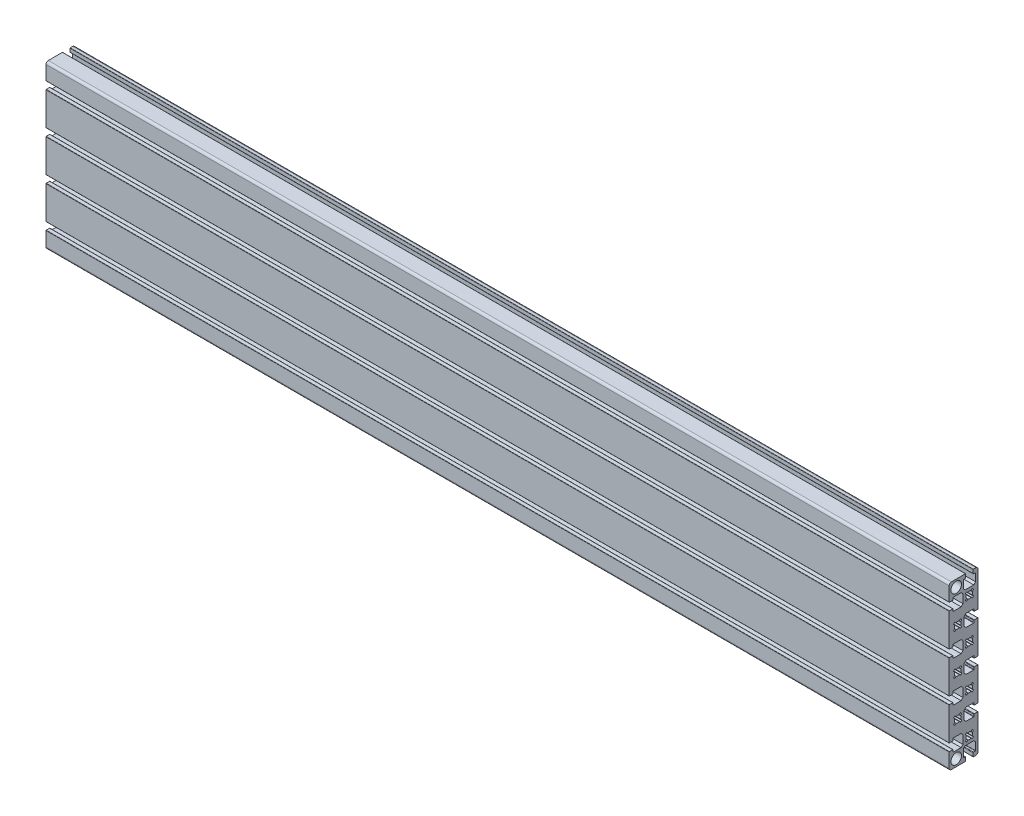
from build123d import *

# Parameters (mm, degrees)
MODEL11_R                        = 5.850000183
F_45_SARJA_1_0051_32X180_1_DEPTH = 1000


with BuildPart() as part:
    # Model11 → 45-sarja 1.0051 32X180_1 (new body)
    with BuildSketch(Plane(origin=(0, 0, 0), x_dir=(0, 0, -1), z_dir=(1, 0, 0))):
        with BuildLine():
            Line((15.606146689, 49.884395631), (15.606146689, 87.984396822))
            ThreePointArc((15.606146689, 87.984396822), (14.873908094, 89.752153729), (13.10614661, 90.484381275))
            Line((13.10614661, 90.484381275), (10.506146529, 90.484381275))
            ThreePointArc((10.506146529, 90.484381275), (10.294014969, 90.396513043), (10.206147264, 90.184381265))
            Line((10.206147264, 90.184381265), (10.206147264, 86.48438115))
            ThreePointArc((10.206147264, 86.48438115), (10.352593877, 86.130827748), (10.706147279, 85.984381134))
            Line((10.706147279, 85.984381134), (12.606147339, 85.984381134))
            ThreePointArc((12.606147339, 85.984381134), (12.818279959, 85.896511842), (12.906146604, 85.684378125))
            Line((12.906146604, 85.684378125), (12.906146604, 77.184374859))
            Line((12.906146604, 77.184374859), (10.906146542, 75.184374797))
            Line((10.906146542, 75.184374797), (1.306146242, 75.184374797))
            Line((1.306146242, 75.184374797), (-0.693852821, 77.184374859))
            Line((-0.693852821, 77.184374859), (-0.693852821, 85.684375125))
            ThreePointArc((-0.693852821, 85.684375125), (-0.605985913, 85.896509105), (-0.393852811, 85.984378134))
            Line((-0.393852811, 85.984378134), (1.506147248, 85.984378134))
            ThreePointArc((1.506147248, 85.984378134), (1.85970065, 86.130824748), (2.006147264, 86.48437815))
            Line((2.006147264, 86.48437815), (2.006147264, 90.184375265))
            ThreePointArc((2.006147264, 90.184375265), (1.918281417, 90.396511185), (1.706147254, 90.484381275))
            Line((1.706147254, 90.484381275), (-13.893853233, 90.484381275))
            ThreePointArc((-13.893853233, 90.484381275), (-15.661613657, 89.75215479), (-16.393853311, 87.984399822))
            Line((-16.393853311, 87.984399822), (-16.393853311, 72.384393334))
            ThreePointArc((-16.393853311, 72.384393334), (-16.305983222, 72.172265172), (-16.093853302, 72.084399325))
            Line((-16.093853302, 72.084399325), (-12.393853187, 72.084399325))
            ThreePointArc((-12.393853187, 72.084399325), (-12.040299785, 72.230845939), (-11.893853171, 72.58439934))
            Line((-11.893853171, 72.58439934), (-11.893853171, 74.4843994))
            ThreePointArc((-11.893853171, 74.4843994), (-11.805985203, 74.696531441), (-11.593853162, 74.784399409))
            Line((-11.593853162, 74.784399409), (-3.093853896, 74.784399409))
            Line((-3.093853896, 74.784399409), (-1.093853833, 72.784399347))
            Line((-1.093853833, 72.784399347), (-1.093853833, 63.184393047))
            Line((-1.093853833, 63.184393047), (-3.093853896, 61.184392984))
            Line((-3.093853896, 61.184392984), (-11.593854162, 61.184392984))
            ThreePointArc((-11.593854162, 61.184392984), (-11.805985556, 61.272261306), (-11.893853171, 61.484392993))
            Line((-11.893853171, 61.484392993), (-11.893853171, 63.384387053))
            ThreePointArc((-11.893853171, 63.384387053), (-12.040297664, 63.737944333), (-12.393853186, 63.884393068))
            Line((-12.393853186, 63.884393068), (-16.093854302, 63.884393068))
            ThreePointArc((-16.093854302, 63.884393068), (-16.305985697, 63.796524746), (-16.393853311, 63.584393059))
            Line((-16.393853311, 63.584393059), (-16.393853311, 27.384393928))
            ThreePointArc((-16.393853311, 27.384393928), (-16.305988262, 27.17225655), (-16.093853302, 27.084385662))
            Line((-16.093853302, 27.084385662), (-12.393853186, 27.084385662))
            ThreePointArc((-12.393853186, 27.084385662), (-12.040299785, 27.230832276), (-11.893853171, 27.584385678))
            Line((-11.893853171, 27.584385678), (-11.893853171, 29.484385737))
            ThreePointArc((-11.893853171, 29.484385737), (-11.805987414, 29.696521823), (-11.593853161, 29.784392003))
            Line((-11.593853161, 29.784392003), (-3.093853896, 29.784392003))
            Line((-3.093853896, 29.784392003), (-1.093853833, 27.78439194))
            Line((-1.093853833, 27.78439194), (-1.093853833, 18.18438564))
            Line((-1.093853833, 18.18438564), (-3.093853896, 16.184385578))
            Line((-3.093853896, 16.184385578), (-11.593854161, 16.184385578))
            ThreePointArc((-11.593854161, 16.184385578), (-11.805985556, 16.2722539), (-11.893853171, 16.484385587))
            Line((-11.893853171, 16.484385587), (-11.893853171, 18.384387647))
            ThreePointArc((-11.893853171, 18.384387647), (-12.040300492, 18.737939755), (-12.393853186, 18.884385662))
            Line((-12.393853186, 18.884385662), (-16.093854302, 18.884385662))
            ThreePointArc((-16.093854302, 18.884385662), (-16.305985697, 18.79651734), (-16.393853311, 18.584385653))
            Line((-16.393853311, 18.584385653), (-16.393853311, -17.615615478))
            ThreePointArc((-16.393853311, -17.615615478), (-16.305986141, -17.827748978), (-16.093853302, -17.915617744))
            Line((-16.093853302, -17.915617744), (-12.393853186, -17.915617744))
            ThreePointArc((-12.393853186, -17.915617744), (-12.040299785, -17.76917113), (-11.893853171, -17.415617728))
            Line((-11.893853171, -17.415617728), (-11.893853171, -15.515617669))
            ThreePointArc((-11.893853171, -15.515617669), (-11.805986, -15.30348417), (-11.593853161, -15.215615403))
            Line((-11.593853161, -15.215615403), (-3.093853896, -15.215615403))
            Line((-3.093853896, -15.215615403), (-1.093853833, -17.215615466))
            Line((-1.093853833, -17.215615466), (-1.093853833, -26.815617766))
            Line((-1.093853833, -26.815617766), (-3.093853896, -28.815617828))
            Line((-3.093853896, -28.815617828), (-11.593854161, -28.815617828))
            ThreePointArc((-11.593854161, -28.815617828), (-11.805985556, -28.727749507), (-11.893853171, -28.515617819))
            Line((-11.893853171, -28.515617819), (-11.893853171, -26.61561576))
            ThreePointArc((-11.893853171, -26.61561576), (-12.040300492, -26.262063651), (-12.393853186, -26.115617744))
            Line((-12.393853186, -26.115617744), (-16.093854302, -26.115617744))
            ThreePointArc((-16.093854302, -26.115617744), (-16.305985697, -26.203486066), (-16.393853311, -26.415617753))
            Line((-16.393853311, -26.415617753), (-16.393853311, -62.615618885))
            ThreePointArc((-16.393853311, -62.615618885), (-16.30598508, -62.827750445), (-16.093853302, -62.91561815))
            Line((-16.093853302, -62.91561815), (-12.393853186, -62.91561815))
            ThreePointArc((-12.393853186, -62.91561815), (-12.040299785, -62.769171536), (-11.893853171, -62.415618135))
            Line((-11.893853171, -62.415618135), (-11.893853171, -60.515618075))
            ThreePointArc((-11.893853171, -60.515618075), (-11.80598494, -60.303486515), (-11.593853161, -60.21561881))
            Line((-11.593853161, -60.21561881), (-3.093853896, -60.21561881))
            Line((-3.093853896, -60.21561881), (-1.093853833, -62.215618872))
            Line((-1.093853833, -62.215618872), (-1.093853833, -71.815617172))
            Line((-1.093853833, -71.815617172), (-3.093853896, -73.815618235))
            Line((-3.093853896, -73.815618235), (-11.593854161, -73.815618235))
            ThreePointArc((-11.593854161, -73.815618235), (-11.805985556, -73.727749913), (-11.893853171, -73.515618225))
            Line((-11.893853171, -73.515618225), (-11.893853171, -71.615618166))
            ThreePointArc((-11.893853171, -71.615618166), (-12.040299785, -71.262064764), (-12.393853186, -71.11561815))
            Line((-12.393853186, -71.11561815), (-16.093854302, -71.11561815))
            ThreePointArc((-16.093854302, -71.11561815), (-16.305985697, -71.203486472), (-16.393853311, -71.41561816))
            Line((-16.393853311, -71.41561816), (-16.393853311, -87.015618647))
            ThreePointArc((-16.393853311, -87.015618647), (-15.661620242, -88.783385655), (-13.893853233, -89.515618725))
            Line((-13.893853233, -89.515618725), (1.706147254, -89.515618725))
            ThreePointArc((1.706147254, -89.515618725), (1.918279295, -89.427750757), (2.006147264, -89.215618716))
            Line((2.006147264, -89.215618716), (2.006147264, -85.5156186))
            ThreePointArc((2.006147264, -85.5156186), (1.85970065, -85.162065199), (1.506147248, -85.015618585))
            Line((1.506147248, -85.015618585), (-0.393852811, -85.015618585))
            ThreePointArc((-0.393852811, -85.015618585), (-0.605984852, -84.927750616), (-0.693852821, -84.715618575))
            Line((-0.693852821, -84.715618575), (-0.693852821, -76.21561831))
            Line((-0.693852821, -76.21561831), (1.306146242, -74.215618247))
            Line((1.306146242, -74.215618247), (10.906146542, -74.215618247))
            Line((10.906146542, -74.215618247), (12.906146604, -76.21561831))
            Line((12.906146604, -76.21561831), (12.906146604, -84.715618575))
            ThreePointArc((12.906146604, -84.715618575), (12.818278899, -84.927750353), (12.606147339, -85.015618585))
            Line((12.606147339, -85.015618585), (10.706147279, -85.015618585))
            ThreePointArc((10.706147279, -85.015618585), (10.352593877, -85.162065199), (10.206147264, -85.5156186))
            Line((10.206147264, -85.5156186), (10.206147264, -89.215618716))
            ThreePointArc((10.206147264, -89.215618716), (10.294014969, -89.427750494), (10.506146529, -89.515618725))
            Line((10.506146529, -89.515618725), (13.10614661, -89.515618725))
            ThreePointArc((13.10614661, -89.515618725), (14.873913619, -88.783385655), (15.606146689, -87.015618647))
            Line((15.606146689, -87.015618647), (15.606146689, -48.915619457))
            ThreePointArc((15.606146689, -48.915619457), (15.518279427, -48.703486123), (15.306146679, -48.615617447))
            Line((15.306146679, -48.615617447), (11.606146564, -48.615617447))
            ThreePointArc((11.606146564, -48.615617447), (11.252593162, -48.762064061), (11.106146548, -49.115617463))
            Line((11.106146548, -49.115617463), (11.106146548, -51.015617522))
            ThreePointArc((11.106146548, -51.015617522), (11.01827858, -51.227749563), (10.806146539, -51.315617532))
            Line((10.806146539, -51.315617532), (2.306146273, -51.315617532))
            Line((2.306146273, -51.315617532), (0.30614621, -49.315617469))
            Line((0.30614621, -49.315617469), (0.30614621, -39.715619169))
            Line((0.30614621, -39.715619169), (2.306146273, -37.715619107))
            Line((2.306146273, -37.715619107), (10.806146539, -37.715619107))
            ThreePointArc((10.806146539, -37.715619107), (11.01827858, -37.803487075), (11.106146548, -38.015619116))
            Line((11.106146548, -38.015619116), (11.106146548, -39.915621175))
            ThreePointArc((11.106146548, -39.915621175), (11.252594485, -40.269172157), (11.606146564, -40.415617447))
            Line((11.606146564, -40.415617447), (15.306146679, -40.415617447))
            ThreePointArc((15.306146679, -40.415617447), (15.518278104, -40.327750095), (15.606146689, -40.115619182))
            Line((15.606146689, -40.115619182), (15.606146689, -3.91562005))
            ThreePointArc((15.606146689, -3.91562005), (15.518279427, -3.703486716), (15.306146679, -3.615618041))
            Line((15.306146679, -3.615618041), (11.606146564, -3.615618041))
            ThreePointArc((11.606146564, -3.615618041), (11.252593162, -3.762064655), (11.106146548, -4.115618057))
            Line((11.106146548, -4.115618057), (11.106146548, -6.015618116))
            ThreePointArc((11.106146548, -6.015618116), (11.01827858, -6.227750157), (10.806146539, -6.315618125))
            Line((10.806146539, -6.315618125), (2.306146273, -6.315618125))
            Line((2.306146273, -6.315618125), (0.30614621, -4.315618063))
            Line((0.30614621, -4.315618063), (0.30614621, 5.284388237))
            Line((0.30614621, 5.284388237), (2.306146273, 7.2843883))
            Line((2.306146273, 7.2843883), (10.806146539, 7.2843883))
            ThreePointArc((10.806146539, 7.2843883), (11.01827858, 7.196520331), (11.106146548, 6.98438829))
            Line((11.106146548, 6.98438829), (11.106146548, 5.084386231))
            ThreePointArc((11.106146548, 5.084386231), (11.252591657, 4.730830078), (11.606146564, 4.584381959))
            Line((11.606146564, 4.584381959), (15.306146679, 4.584381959))
            ThreePointArc((15.306146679, 4.584381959), (15.518281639, 4.672252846), (15.606146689, 4.884390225))
            Line((15.606146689, 4.884390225), (15.606146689, 41.084395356))
            ThreePointArc((15.606146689, 41.084395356), (15.518276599, 41.296523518), (15.306146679, 41.384389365))
            Line((15.306146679, 41.384389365), (11.606146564, 41.384389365))
            ThreePointArc((11.606146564, 41.384389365), (11.252593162, 41.237942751), (11.106146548, 40.88438935))
            Line((11.106146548, 40.88438935), (11.106146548, 38.98438929))
            ThreePointArc((11.106146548, 38.98438929), (11.01827858, 38.772257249), (10.806146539, 38.684389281))
            Line((10.806146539, 38.684389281), (2.306146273, 38.684389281))
            Line((2.306146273, 38.684389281), (0.30614621, 40.684389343))
            Line((0.30614621, 40.684389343), (0.30614621, 50.284395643))
            Line((0.30614621, 50.284395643), (2.306146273, 52.284395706))
            Line((2.306146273, 52.284395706), (10.806146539, 52.284395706))
            ThreePointArc((10.806146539, 52.284395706), (11.01827858, 52.196527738), (11.106146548, 51.984395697))
            Line((11.106146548, 51.984395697), (11.106146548, 50.084401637))
            ThreePointArc((11.106146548, 50.084401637), (11.252588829, 49.730840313), (11.606146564, 49.584389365))
            Line((11.606146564, 49.584389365), (15.306146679, 49.584389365))
            ThreePointArc((15.306146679, 49.584389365), (15.518280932, 49.672259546), (15.606146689, 49.884395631))
        make_face()
        with Locations((-8.543853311, 82.634381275)):
            Circle(MODEL11_R, mode=Mode.SUBTRACT)
        with Locations((-8.543853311, -81.665618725)):
            Circle(MODEL11_R, mode=Mode.SUBTRACT)
        with BuildLine():
            Line((10.490204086, 71.378498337), (9.500254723, 72.3684487))
            ThreePointArc((9.500254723, 72.3684487), (9.288122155, 72.456316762), (9.075989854, 72.368448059))
            Line((9.075989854, 72.368448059), (8.055218, 71.347677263))
            ThreePointArc((8.055218, 71.347677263), (7.892831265, 71.263962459), (7.711995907, 71.289966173))
            ThreePointArc((7.711995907, 71.289966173), (6.106141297, 71.659386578), (4.500286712, 71.289966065))
            ThreePointArc((4.500286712, 71.289966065), (4.319451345, 71.26396234), (4.157064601, 71.347677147))
            Line((4.157064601, 71.347677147), (3.136293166, 72.368447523))
            ThreePointArc((3.136293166, 72.368447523), (2.924161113, 72.456315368), (2.712029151, 72.368447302))
            Line((2.712029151, 72.368447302), (1.722080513, 71.378497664))
            ThreePointArc((1.722080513, 71.378497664), (1.634212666, 71.166365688), (1.72208062, 70.954233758))
            Line((1.72208062, 70.954233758), (2.742850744, 69.933463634))
            ThreePointArc((2.742850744, 69.933463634), (2.826565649, 69.771076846), (2.800561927, 69.590241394))
            ThreePointArc((2.800561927, 69.590241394), (2.431141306, 67.984386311), (2.800562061, 66.378531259))
            ThreePointArc((2.800562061, 66.378531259), (2.826565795, 66.197695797), (2.742850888, 66.035308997))
            Line((2.742850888, 66.035308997), (1.722080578, 65.014538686))
            ThreePointArc((1.722080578, 65.014538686), (1.634212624, 64.802407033), (1.722080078, 64.590275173))
            Line((1.722080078, 64.590275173), (2.712029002, 63.600325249))
            ThreePointArc((2.712029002, 63.600325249), (2.92416104, 63.512457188), (3.136293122, 63.600325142))
            Line((3.136293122, 63.600325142), (4.157064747, 64.621095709))
            ThreePointArc((4.157064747, 64.621095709), (4.319451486, 64.704810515), (4.500286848, 64.678806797))
            ThreePointArc((4.500286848, 64.678806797), (6.106141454, 64.309386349), (7.711996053, 64.678806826))
            ThreePointArc((7.711996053, 64.678806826), (7.892831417, 64.704810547), (8.055218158, 64.621095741))
            Line((8.055218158, 64.621095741), (9.075990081, 63.600324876))
            ThreePointArc((9.075990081, 63.600324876), (9.288122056, 63.512457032), (9.500253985, 63.600324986))
            Line((9.500253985, 63.600324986), (10.490203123, 64.590275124))
            ThreePointArc((10.490203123, 64.590275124), (10.57807097, 64.802406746), (10.490203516, 65.01453853))
            Line((10.490203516, 65.01453853), (9.469432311, 66.035309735))
            ThreePointArc((9.469432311, 66.035309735), (9.385717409, 66.197696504), (9.411721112, 66.378531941))
            ThreePointArc((9.411721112, 66.378531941), (9.781141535, 67.984386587), (9.411721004, 69.590241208))
            ThreePointArc((9.411721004, 69.590241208), (9.385717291, 69.771076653), (9.469432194, 69.933463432))
            Line((9.469432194, 69.933463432), (10.490203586, 70.954234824))
            ThreePointArc((10.490203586, 70.954234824), (10.57807154, 71.166366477), (10.490204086, 71.378498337))
        make_face(mode=Mode.SUBTRACT)
        with BuildLine():
            Line((10.490209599, -63.621506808), (9.500259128, -62.631556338))
            ThreePointArc((9.500259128, -62.631556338), (9.288126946, -62.543688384), (9.075994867, -62.631556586))
            Line((9.075994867, -62.631556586), (8.055223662, -63.652327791))
            ThreePointArc((8.055223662, -63.652327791), (7.892836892, -63.736042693), (7.712001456, -63.71003899))
            ThreePointArc((7.712001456, -63.71003899), (6.10614681, -63.340618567), (4.500292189, -63.710039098))
            ThreePointArc((4.500292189, -63.710039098), (4.319456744, -63.736042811), (4.157069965, -63.652327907))
            Line((4.157069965, -63.652327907), (3.136299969, -62.631557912))
            ThreePointArc((3.136299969, -62.631557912), (2.924167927, -62.543689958), (2.712035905, -62.631557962))
            Line((2.712035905, -62.631557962), (1.722086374, -63.621507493))
            ThreePointArc((1.722086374, -63.621507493), (1.63421842, -63.8336395), (1.722086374, -64.045771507))
            Line((1.722086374, -64.045771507), (2.742856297, -65.066541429))
            ThreePointArc((2.742856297, -65.066541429), (2.826571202, -65.22892822), (2.800567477, -65.409763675))
            ThreePointArc((2.800567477, -65.409763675), (2.431146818, -67.015618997), (2.800567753, -68.621474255))
            ThreePointArc((2.800567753, -68.621474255), (2.826571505, -68.802309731), (2.742856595, -68.964696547))
            Line((2.742856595, -68.964696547), (1.722086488, -69.985466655))
            ThreePointArc((1.722086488, -69.985466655), (1.634218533, -70.197598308), (1.722085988, -70.409730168))
            Line((1.722085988, -70.409730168), (2.712035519, -71.399679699))
            ThreePointArc((2.712035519, -71.399679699), (2.924167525, -71.487547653), (3.136299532, -71.399679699))
            Line((3.136299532, -71.399679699), (4.157069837, -70.378909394))
            ThreePointArc((4.157069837, -70.378909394), (4.319456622, -70.295194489), (4.500292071, -70.321198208))
            ThreePointArc((4.500292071, -70.321198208), (6.106147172, -70.690618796), (7.712002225, -70.321197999))
            ThreePointArc((7.712002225, -70.321197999), (7.892837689, -70.29519426), (8.055224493, -70.378909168))
            Line((8.055224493, -70.378909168), (9.075994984, -71.399679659))
            ThreePointArc((9.075994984, -71.399679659), (9.288126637, -71.487547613), (9.500258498, -71.399680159))
            Line((9.500258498, -71.399680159), (10.490208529, -70.409730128))
            ThreePointArc((10.490208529, -70.409730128), (10.578076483, -70.197598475), (10.490209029, -69.985466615))
            Line((10.490209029, -69.985466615), (9.469437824, -68.96469541))
            ThreePointArc((9.469437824, -68.96469541), (9.385722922, -68.802308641), (9.411726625, -68.621473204))
            ThreePointArc((9.411726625, -68.621473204), (9.781147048, -67.015618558), (9.411726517, -65.409763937))
            ThreePointArc((9.411726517, -65.409763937), (9.385722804, -65.228928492), (9.469437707, -65.066541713))
            Line((9.469437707, -65.066541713), (10.490209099, -64.045770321))
            ThreePointArc((10.490209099, -64.045770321), (10.578077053, -63.833638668), (10.490209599, -63.621506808))
        make_face(mode=Mode.SUBTRACT)
        with BuildLine():
            Line((-2.509793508, -41.121504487), (-3.499743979, -40.131554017))
            ThreePointArc((-3.499743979, -40.131554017), (-3.711876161, -40.043686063), (-3.92400824, -40.131554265))
            Line((-3.92400824, -40.131554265), (-4.944779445, -41.15232547))
            ThreePointArc((-4.944779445, -41.15232547), (-5.107166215, -41.236040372), (-5.288001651, -41.210036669))
            ThreePointArc((-5.288001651, -41.210036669), (-6.893856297, -40.840616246), (-8.499710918, -41.210036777))
            ThreePointArc((-8.499710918, -41.210036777), (-8.680546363, -41.23604049), (-8.842933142, -41.152325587))
            Line((-8.842933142, -41.152325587), (-9.863703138, -40.131555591))
            ThreePointArc((-9.863703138, -40.131555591), (-10.07583518, -40.043687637), (-10.287967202, -40.131555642))
            Line((-10.287967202, -40.131555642), (-11.277916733, -41.121505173))
            ThreePointArc((-11.277916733, -41.121505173), (-11.365784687, -41.333637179), (-11.277916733, -41.545769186))
            Line((-11.277916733, -41.545769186), (-10.25714681, -42.566539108))
            ThreePointArc((-10.25714681, -42.566539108), (-10.173431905, -42.7289259), (-10.19943563, -42.909761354))
            ThreePointArc((-10.19943563, -42.909761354), (-10.568856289, -44.515616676), (-10.199435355, -46.121471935))
            ThreePointArc((-10.199435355, -46.121471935), (-10.173431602, -46.30230741), (-10.257146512, -46.464694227))
            Line((-10.257146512, -46.464694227), (-11.277916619, -47.485464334))
            ThreePointArc((-11.277916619, -47.485464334), (-11.365784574, -47.697595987), (-11.277917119, -47.909727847))
            Line((-11.277917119, -47.909727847), (-10.287967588, -48.899677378))
            ThreePointArc((-10.287967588, -48.899677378), (-10.075835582, -48.987545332), (-9.863703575, -48.899677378))
            Line((-9.863703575, -48.899677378), (-8.84293327, -47.878907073))
            ThreePointArc((-8.84293327, -47.878907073), (-8.680546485, -47.795192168), (-8.499711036, -47.821195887))
            ThreePointArc((-8.499711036, -47.821195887), (-6.893855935, -48.190616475), (-5.288000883, -47.821195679))
            ThreePointArc((-5.288000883, -47.821195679), (-5.107165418, -47.79519194), (-4.944778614, -47.878906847))
            Line((-4.944778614, -47.878906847), (-3.924008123, -48.899677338))
            ThreePointArc((-3.924008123, -48.899677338), (-3.71187647, -48.987545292), (-3.499744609, -48.899677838))
            Line((-3.499744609, -48.899677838), (-2.509794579, -47.909727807))
            ThreePointArc((-2.509794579, -47.909727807), (-2.421926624, -47.697596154), (-2.509794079, -47.485464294))
            Line((-2.509794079, -47.485464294), (-3.530565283, -46.464693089))
            ThreePointArc((-3.530565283, -46.464693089), (-3.614280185, -46.30230632), (-3.588276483, -46.121470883))
            ThreePointArc((-3.588276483, -46.121470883), (-3.218856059, -44.515616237), (-3.58827659, -42.909761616))
            ThreePointArc((-3.58827659, -42.909761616), (-3.614280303, -42.728926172), (-3.5305654, -42.566539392))
            Line((-3.5305654, -42.566539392), (-2.509794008, -41.545768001))
            ThreePointArc((-2.509794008, -41.545768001), (-2.421926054, -41.333636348), (-2.509793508, -41.121504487))
        make_face(mode=Mode.SUBTRACT)
        with BuildLine():
            Line((10.490207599, -18.621505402), (9.500258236, -17.631555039))
            ThreePointArc((9.500258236, -17.631555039), (9.288125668, -17.543686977), (9.075993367, -17.63155568))
            Line((9.075993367, -17.63155568), (8.055221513, -18.652326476))
            ThreePointArc((8.055221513, -18.652326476), (7.892834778, -18.73604128), (7.71199942, -18.710037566))
            ThreePointArc((7.71199942, -18.710037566), (6.10614481, -18.34061716), (4.500290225, -18.710037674))
            ThreePointArc((4.500290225, -18.710037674), (4.319454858, -18.736041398), (4.157068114, -18.652326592))
            Line((4.157068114, -18.652326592), (3.136296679, -17.631556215))
            ThreePointArc((3.136296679, -17.631556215), (2.924164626, -17.543688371), (2.712032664, -17.631556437))
            Line((2.712032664, -17.631556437), (1.722084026, -18.621506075))
            ThreePointArc((1.722084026, -18.621506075), (1.634216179, -18.83363805), (1.722084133, -19.045769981))
            Line((1.722084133, -19.045769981), (2.742854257, -20.066540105))
            ThreePointArc((2.742854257, -20.066540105), (2.826569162, -20.228926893), (2.80056544, -20.409762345))
            ThreePointArc((2.80056544, -20.409762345), (2.431144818, -22.015617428), (2.800565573, -23.62147248))
            ThreePointArc((2.800565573, -23.62147248), (2.826569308, -23.802307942), (2.742854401, -23.964694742))
            Line((2.742854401, -23.964694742), (1.722084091, -24.985465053))
            ThreePointArc((1.722084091, -24.985465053), (1.634216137, -25.197596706), (1.722083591, -25.409728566))
            Line((1.722083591, -25.409728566), (2.712032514, -26.39967849))
            ThreePointArc((2.712032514, -26.39967849), (2.924164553, -26.487546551), (3.136296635, -26.399678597))
            Line((3.136296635, -26.399678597), (4.15706826, -25.37890803))
            ThreePointArc((4.15706826, -25.37890803), (4.319454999, -25.295193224), (4.500290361, -25.321196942))
            ThreePointArc((4.500290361, -25.321196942), (6.106144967, -25.69061739), (7.711999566, -25.321196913))
            ThreePointArc((7.711999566, -25.321196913), (7.89283493, -25.295193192), (8.055221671, -25.378907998))
            Line((8.055221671, -25.378907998), (9.075993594, -26.399678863))
            ThreePointArc((9.075993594, -26.399678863), (9.288125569, -26.487546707), (9.500257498, -26.399678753))
            Line((9.500257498, -26.399678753), (10.490206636, -25.409728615))
            ThreePointArc((10.490206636, -25.409728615), (10.578074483, -25.197596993), (10.490207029, -24.985465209))
            Line((10.490207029, -24.985465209), (9.469435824, -23.964694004))
            ThreePointArc((9.469435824, -23.964694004), (9.385720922, -23.802307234), (9.411724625, -23.621471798))
            ThreePointArc((9.411724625, -23.621471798), (9.781145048, -22.015617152), (9.411724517, -20.409762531))
            ThreePointArc((9.411724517, -20.409762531), (9.385720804, -20.228927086), (9.469435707, -20.066540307))
            Line((9.469435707, -20.066540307), (10.490207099, -19.045768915))
            ThreePointArc((10.490207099, -19.045768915), (10.578075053, -18.833637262), (10.490207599, -18.621505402))
        make_face(mode=Mode.SUBTRACT)
        with BuildLine():
            Line((-2.509791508, 3.878494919), (-3.499740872, 4.868445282))
            ThreePointArc((-3.499740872, 4.868445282), (-3.711873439, 4.956313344), (-3.92400574, 4.868444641))
            Line((-3.92400574, 4.868444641), (-4.944777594, 3.847673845))
            ThreePointArc((-4.944777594, 3.847673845), (-5.107164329, 3.763959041), (-5.287999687, 3.789962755))
            ThreePointArc((-5.287999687, 3.789962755), (-6.893854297, 4.15938316), (-8.499708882, 3.789962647))
            ThreePointArc((-8.499708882, 3.789962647), (-8.680544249, 3.763958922), (-8.842930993, 3.847673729))
            Line((-8.842930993, 3.847673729), (-9.863702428, 4.868444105))
            ThreePointArc((-9.863702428, 4.868444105), (-10.075834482, 4.95631195), (-10.287966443, 4.868443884))
            Line((-10.287966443, 4.868443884), (-11.277915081, 3.878494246))
            ThreePointArc((-11.277915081, 3.878494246), (-11.365782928, 3.66636227), (-11.277914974, 3.45423034))
            Line((-11.277914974, 3.45423034), (-10.25714485, 2.433460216))
            ThreePointArc((-10.25714485, 2.433460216), (-10.173429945, 2.271073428), (-10.199433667, 2.090237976))
            ThreePointArc((-10.199433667, 2.090237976), (-10.568854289, 0.484382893), (-10.199433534, -1.121472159))
            ThreePointArc((-10.199433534, -1.121472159), (-10.173429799, -1.302307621), (-10.257144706, -1.464694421))
            Line((-10.257144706, -1.464694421), (-11.277915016, -2.485464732))
            ThreePointArc((-11.277915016, -2.485464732), (-11.365782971, -2.697596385), (-11.277915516, -2.909728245))
            Line((-11.277915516, -2.909728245), (-10.287966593, -3.899678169))
            ThreePointArc((-10.287966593, -3.899678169), (-10.075834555, -3.98754623), (-9.863702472, -3.899678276))
            Line((-9.863702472, -3.899678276), (-8.842930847, -2.878907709))
            ThreePointArc((-8.842930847, -2.878907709), (-8.680544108, -2.795192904), (-8.499708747, -2.821196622))
            ThreePointArc((-8.499708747, -2.821196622), (-6.89385414, -3.190617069), (-5.287999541, -2.821196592))
            ThreePointArc((-5.287999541, -2.821196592), (-5.107164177, -2.795192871), (-4.944777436, -2.878907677))
            Line((-4.944777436, -2.878907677), (-3.924005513, -3.899678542))
            ThreePointArc((-3.924005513, -3.899678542), (-3.711873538, -3.987546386), (-3.499741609, -3.899678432))
            Line((-3.499741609, -3.899678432), (-2.509792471, -2.909728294))
            ThreePointArc((-2.509792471, -2.909728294), (-2.421924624, -2.697596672), (-2.509792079, -2.485464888))
            Line((-2.509792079, -2.485464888), (-3.530563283, -1.464693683))
            ThreePointArc((-3.530563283, -1.464693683), (-3.614278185, -1.302306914), (-3.588274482, -1.121471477))
            ThreePointArc((-3.588274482, -1.121471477), (-3.218854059, 0.484383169), (-3.58827459, 2.09023779))
            ThreePointArc((-3.58827459, 2.09023779), (-3.614278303, 2.271073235), (-3.5305634, 2.433460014))
            Line((-3.5305634, 2.433460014), (-2.509792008, 3.454231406))
            ThreePointArc((-2.509792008, 3.454231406), (-2.421924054, 3.666363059), (-2.509791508, 3.878494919))
        make_face(mode=Mode.SUBTRACT)
        with BuildLine():
            Line((10.490207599, 26.378496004), (9.500258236, 27.368446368))
            ThreePointArc((9.500258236, 27.368446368), (9.288125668, 27.456314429), (9.075993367, 27.368445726))
            Line((9.075993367, 27.368445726), (8.055221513, 26.347674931))
            ThreePointArc((8.055221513, 26.347674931), (7.892834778, 26.263960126), (7.71199942, 26.28996384))
            ThreePointArc((7.71199942, 26.28996384), (6.10614481, 26.659384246), (4.500290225, 26.289963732))
            ThreePointArc((4.500290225, 26.289963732), (4.319454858, 26.263960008), (4.157068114, 26.347674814))
            Line((4.157068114, 26.347674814), (3.136296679, 27.368445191))
            ThreePointArc((3.136296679, 27.368445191), (2.924164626, 27.456313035), (2.712032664, 27.368444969))
            Line((2.712032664, 27.368444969), (1.722084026, 26.378495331))
            ThreePointArc((1.722084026, 26.378495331), (1.634216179, 26.166363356), (1.722084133, 25.954231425))
            Line((1.722084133, 25.954231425), (2.742854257, 24.933461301))
            ThreePointArc((2.742854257, 24.933461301), (2.826569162, 24.771074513), (2.80056544, 24.590239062))
            ThreePointArc((2.80056544, 24.590239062), (2.431144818, 22.984383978), (2.800565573, 21.378528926))
            ThreePointArc((2.800565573, 21.378528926), (2.826569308, 21.197693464), (2.742854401, 21.035306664))
            Line((2.742854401, 21.035306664), (1.722084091, 20.014536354))
            ThreePointArc((1.722084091, 20.014536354), (1.634216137, 19.802404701), (1.722083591, 19.59027284))
            Line((1.722083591, 19.59027284), (2.712032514, 18.600322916))
            ThreePointArc((2.712032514, 18.600322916), (2.924164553, 18.512454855), (3.136296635, 18.600322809))
            Line((3.136296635, 18.600322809), (4.15706826, 19.621093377))
            ThreePointArc((4.15706826, 19.621093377), (4.319454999, 19.704808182), (4.500290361, 19.678804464))
            ThreePointArc((4.500290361, 19.678804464), (6.106144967, 19.309384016), (7.711999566, 19.678804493))
            ThreePointArc((7.711999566, 19.678804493), (7.89283493, 19.704808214), (8.055221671, 19.621093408))
            Line((8.055221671, 19.621093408), (9.075993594, 18.600322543))
            ThreePointArc((9.075993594, 18.600322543), (9.288125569, 18.512454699), (9.500257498, 18.600322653))
            Line((9.500257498, 18.600322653), (10.490206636, 19.590272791))
            ThreePointArc((10.490206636, 19.590272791), (10.578074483, 19.802404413), (10.490207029, 20.014536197))
            Line((10.490207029, 20.014536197), (9.469435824, 21.035307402))
            ThreePointArc((9.469435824, 21.035307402), (9.385720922, 21.197694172), (9.411724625, 21.378529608))
            ThreePointArc((9.411724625, 21.378529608), (9.781145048, 22.984384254), (9.411724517, 24.590238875))
            ThreePointArc((9.411724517, 24.590238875), (9.385720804, 24.77107432), (9.469435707, 24.933461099))
            Line((9.469435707, 24.933461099), (10.490207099, 25.954232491))
            ThreePointArc((10.490207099, 25.954232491), (10.578075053, 26.166364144), (10.490207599, 26.378496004))
        make_face(mode=Mode.SUBTRACT)
        with BuildLine():
            Line((-2.50979682, 48.878497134), (-3.499746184, 49.868447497))
            ThreePointArc((-3.499746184, 49.868447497), (-3.711878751, 49.956315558), (-3.924011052, 49.868446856))
            Line((-3.924011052, 49.868446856), (-4.944782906, 48.84767606))
            ThreePointArc((-4.944782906, 48.84767606), (-5.107169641, 48.763961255), (-5.288005, 48.789964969))
            ThreePointArc((-5.288005, 48.789964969), (-6.893859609, 49.159385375), (-8.499714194, 48.789964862))
            ThreePointArc((-8.499714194, 48.789964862), (-8.680549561, 48.763961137), (-8.842936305, 48.847675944))
            Line((-8.842936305, 48.847675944), (-9.86370774, 49.86844632))
            ThreePointArc((-9.86370774, 49.86844632), (-10.075839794, 49.956314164), (-10.287971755, 49.868446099))
            Line((-10.287971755, 49.868446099), (-11.277920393, 48.878496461))
            ThreePointArc((-11.277920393, 48.878496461), (-11.36578824, 48.666364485), (-11.277920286, 48.454232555))
            Line((-11.277920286, 48.454232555), (-10.257150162, 47.43346243))
            ThreePointArc((-10.257150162, 47.43346243), (-10.173435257, 47.271075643), (-10.199438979, 47.090240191))
            ThreePointArc((-10.199438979, 47.090240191), (-10.568859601, 45.484385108), (-10.199438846, 43.878530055))
            ThreePointArc((-10.199438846, 43.878530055), (-10.173435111, 43.697694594), (-10.257150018, 43.535307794))
            Line((-10.257150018, 43.535307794), (-11.277920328, 42.514537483))
            ThreePointArc((-11.277920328, 42.514537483), (-11.365788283, 42.30240583), (-11.277920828, 42.09027397))
            Line((-11.277920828, 42.09027397), (-10.287971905, 41.100324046))
            ThreePointArc((-10.287971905, 41.100324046), (-10.075839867, 41.012455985), (-9.863707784, 41.100323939))
            Line((-9.863707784, 41.100323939), (-8.842936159, 42.121094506))
            ThreePointArc((-8.842936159, 42.121094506), (-8.68054942, 42.204809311), (-8.499714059, 42.178805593))
            ThreePointArc((-8.499714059, 42.178805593), (-6.893859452, 41.809385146), (-5.288004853, 42.178805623))
            ThreePointArc((-5.288004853, 42.178805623), (-5.107169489, 42.204809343), (-4.944782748, 42.121094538))
            Line((-4.944782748, 42.121094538), (-3.924010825, 41.100323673))
            ThreePointArc((-3.924010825, 41.100323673), (-3.71187885, 41.012455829), (-3.499746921, 41.100323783))
            Line((-3.499746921, 41.100323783), (-2.509797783, 42.090273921))
            ThreePointArc((-2.509797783, 42.090273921), (-2.421929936, 42.302405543), (-2.509797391, 42.514537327))
            Line((-2.509797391, 42.514537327), (-3.530568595, 43.535308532))
            ThreePointArc((-3.530568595, 43.535308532), (-3.614283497, 43.697695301), (-3.588279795, 43.878530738))
            ThreePointArc((-3.588279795, 43.878530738), (-3.218859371, 45.484385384), (-3.588279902, 47.090240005))
            ThreePointArc((-3.588279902, 47.090240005), (-3.614283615, 47.27107545), (-3.530568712, 47.433462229))
            Line((-3.530568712, 47.433462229), (-2.50979732, 48.454233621))
            ThreePointArc((-2.50979732, 48.454233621), (-2.421929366, 48.666365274), (-2.50979682, 48.878497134))
        make_face(mode=Mode.SUBTRACT)
    extrude(amount=F_45_SARJA_1_0051_32X180_1_DEPTH)


solid = part.part
